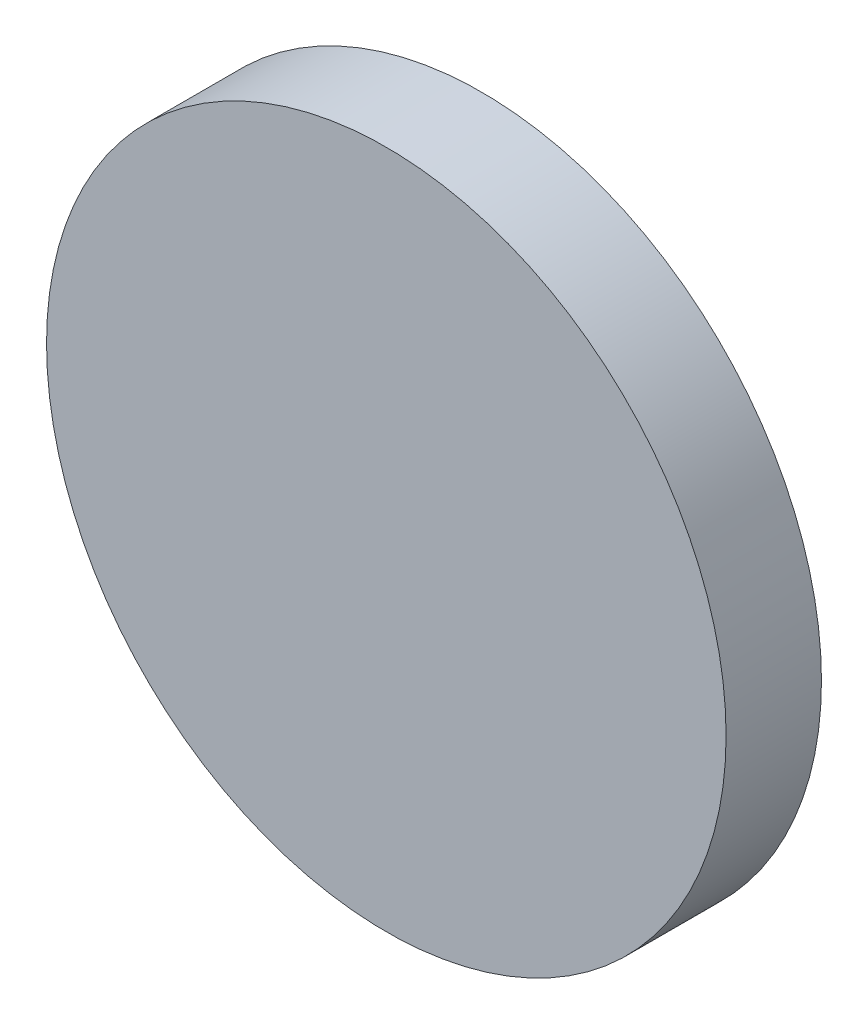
from build123d import *

# Parameters (mm, degrees)
SKETCH1_R           = 6.5151
BOSS_EXTRUDE1_DEPTH = 1.8288


with BuildPart() as part:
    # Sketch1 → Boss-Extrude1 (new body)
    with BuildSketch(Plane.XY):
        Circle(SKETCH1_R)
    extrude(amount=BOSS_EXTRUDE1_DEPTH)


solid = part.part
